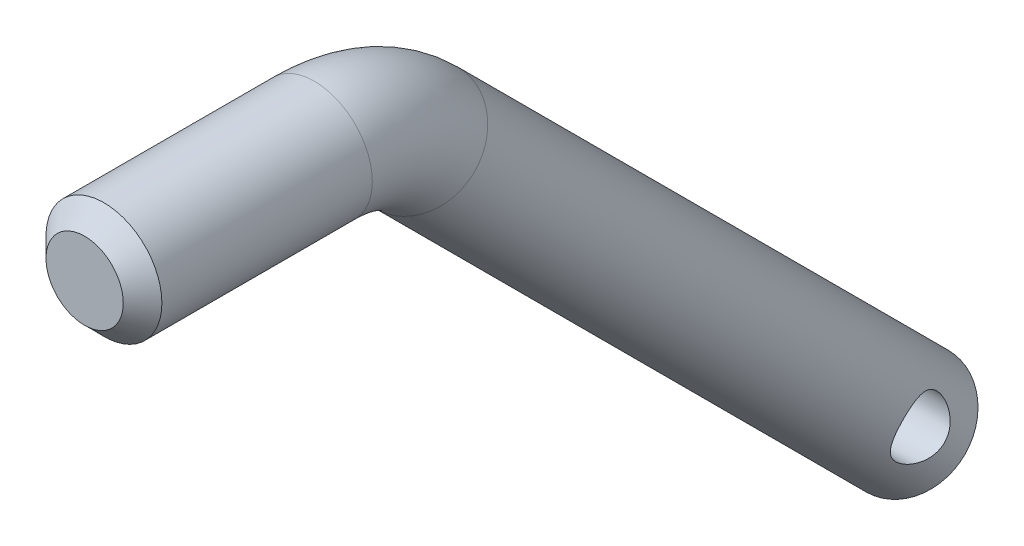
from build123d import *

# Parameters (mm, degrees)
ESQUISSE1_R             = 6
CHANFREIN1_SIZE         = 2
ESQUISSE3_R             = 3
ENL_V_MAT_EXTRU_1_DEPTH = 7


with BuildPart() as part:
    # Base-Balayage: sweep along a path in Esquisse2
    with BuildLine(Plane(origin=(0, 0, 0), x_dir=(0, 0, -1), z_dir=(1, 0, 0))) as base_balayage_path:
        Line((0, 0), (23.786796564, 0))
        ThreePointArc((23.786796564, 0), (29.52704805, -1.141807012), (34.393398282, -4.393398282))
        Line((34.393398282, -4.393398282), (86.568542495, -56.568542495))
    # Esquisse1 → Base-Balayage (sweep)
    with BuildSketch(Plane.XY):
        Circle(ESQUISSE1_R)
    sweep(path=base_balayage_path.line)

    # Chanfrein1
    chanfrein1_edges = [part.edges().sort_by_distance(p)[0] for p in [
        (-6, 0, 0),
        (-6, -56.568542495, -86.568542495),
    ]]
    chamfer(chanfrein1_edges, length=CHANFREIN1_SIZE)

    # Esquisse3 → Enl_v. mat.-Extru.1 (cut, symmetric)
    with BuildSketch(Plane(origin=(0, 0, 0), x_dir=(0, 0, -1), z_dir=(1, 0, 0))):
        with Locations((80.911688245, -50.911688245)):
            Circle(ESQUISSE3_R)
    extrude(amount=ENL_V_MAT_EXTRU_1_DEPTH, both=True, mode=Mode.SUBTRACT)


solid = part.part
